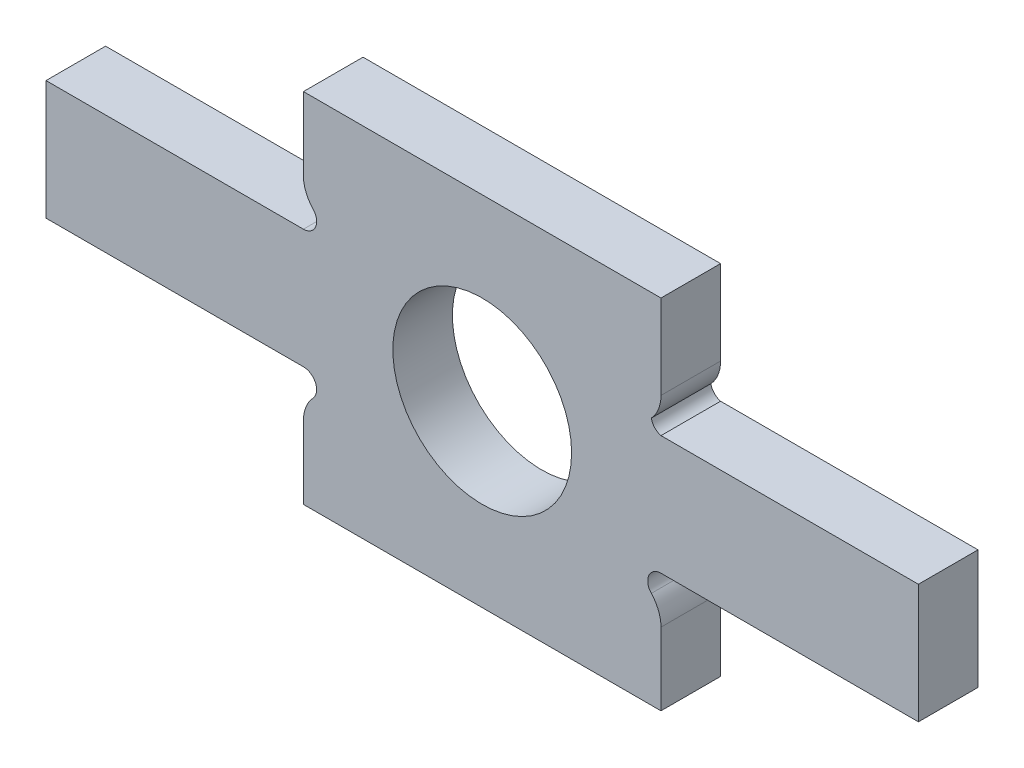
ISO-10303-21;
HEADER;
FILE_DESCRIPTION(('STEP AP214'),'2;1');
FILE_NAME('part.step','',(''),(''),'','','');
FILE_SCHEMA(('AUTOMOTIVE_DESIGN { 1 0 10303 214 1 1 1 1 }'));
ENDSEC;
DATA;
#1=APPLICATION_CONTEXT('core data for automotive mechanical design processes');
#2=APPLICATION_PROTOCOL_DEFINITION('international standard','automotive_design',2000,#1);
#3=PRODUCT_CONTEXT('',#1,'mechanical');
#4=PRODUCT('Part','Part','',(#3));
#5=PRODUCT_RELATED_PRODUCT_CATEGORY('part','',(#4));
#6=PRODUCT_DEFINITION_FORMATION('','',#4);
#7=PRODUCT_DEFINITION_CONTEXT('part definition',#1,'design');
#8=PRODUCT_DEFINITION('design','',#6,#7);
#9=PRODUCT_DEFINITION_SHAPE('','',#8);
#10=(LENGTH_UNIT() NAMED_UNIT(*) SI_UNIT(.MILLI.,.METRE.));
#11=(NAMED_UNIT(*) PLANE_ANGLE_UNIT() SI_UNIT($,.RADIAN.));
#12=(NAMED_UNIT(*) SI_UNIT($,.STERADIAN.) SOLID_ANGLE_UNIT());
#13=UNCERTAINTY_MEASURE_WITH_UNIT(LENGTH_MEASURE(1.E-05),#10,'distance_accuracy_value','');
#14=(GEOMETRIC_REPRESENTATION_CONTEXT(3) GLOBAL_UNCERTAINTY_ASSIGNED_CONTEXT((#13)) GLOBAL_UNIT_ASSIGNED_CONTEXT((#10,
#11,#12)) REPRESENTATION_CONTEXT('',''));
#15=CARTESIAN_POINT('',(0.,0.,0.));
#16=DIRECTION('',(0.,0.,1.));
#17=DIRECTION('',(1.,0.,0.));
#18=AXIS2_PLACEMENT_3D('',#15,#16,#17);
#19=CARTESIAN_POINT('',(30.0000000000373,-12.2200000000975,10.));
#20=DIRECTION('',(0.,0.,-1.));
#21=DIRECTION('',(-1.,0.,0.));
#22=AXIS2_PLACEMENT_3D('',#19,#20,#21);
#23=CYLINDRICAL_SURFACE('',#22,2.22000000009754);
#24=CARTESIAN_POINT('',(30.0000000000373,-12.2200000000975,0.));
#25=DIRECTION('',(0.,0.,-1.));
#26=DIRECTION('',(1.,0.,0.));
#27=AXIS2_PLACEMENT_3D('',#24,#25,#26);
#28=CIRCLE('',#27,2.22000000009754);
#29=CARTESIAN_POINT('',(28.3795620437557,-13.7374257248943,0.));
#30=VERTEX_POINT('',#29);
#31=CARTESIAN_POINT('',(30.0000000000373,-10.,0.));
#32=VERTEX_POINT('',#31);
#33=EDGE_CURVE('E210',#30,#32,#28,.T.);
#34=ORIENTED_EDGE('',*,*,#33,.T.);
#35=DIRECTION('',(0.,0.,-1.));
#36=VECTOR('',#35,1.);
#37=CARTESIAN_POINT('',(30.0000000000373,-10.,10.));
#38=LINE('',#37,#36);
#39=CARTESIAN_POINT('',(30.0000000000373,-10.,10.));
#40=VERTEX_POINT('',#39);
#41=EDGE_CURVE('E11',#40,#32,#38,.T.);
#42=ORIENTED_EDGE('',*,*,#41,.F.);
#43=CARTESIAN_POINT('',(30.0000000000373,-12.2200000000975,10.));
#44=DIRECTION('',(0.,0.,-1.));
#45=DIRECTION('',(1.,0.,0.));
#46=AXIS2_PLACEMENT_3D('',#43,#44,#45);
#47=CIRCLE('',#46,2.22000000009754);
#48=CARTESIAN_POINT('',(28.3795620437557,-13.7374257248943,10.));
#49=VERTEX_POINT('',#48);
#50=EDGE_CURVE('E249',#49,#40,#47,.T.);
#51=ORIENTED_EDGE('',*,*,#50,.F.);
#52=DIRECTION('',(0.,0.,-1.));
#53=VECTOR('',#52,1.);
#54=CARTESIAN_POINT('',(28.3795620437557,-13.7374257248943,10.));
#55=LINE('',#54,#53);
#56=EDGE_CURVE('E206',#49,#30,#55,.T.);
#57=ORIENTED_EDGE('',*,*,#56,.T.);
#58=EDGE_LOOP('',(#34,#42,#51,#57));
#59=FACE_BOUND('',#58,.T.);
#60=ADVANCED_FACE('F42',(#59),#23,.F.);
#61=CARTESIAN_POINT('',(30.0000000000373,-10.,10.));
#62=DIRECTION('',(0.,1.,0.));
#63=DIRECTION('',(-1.,0.,0.));
#64=AXIS2_PLACEMENT_3D('',#61,#62,#63);
#65=PLANE('',#64);
#66=DIRECTION('',(1.,0.,0.));
#67=VECTOR('',#66,1.);
#68=CARTESIAN_POINT('',(30.0000000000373,-10.,0.));
#69=LINE('',#68,#67);
#70=CARTESIAN_POINT('',(73.2000000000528,-9.99999999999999,0.));
#71=VERTEX_POINT('',#70);
#72=EDGE_CURVE('E213',#32,#71,#69,.T.);
#73=ORIENTED_EDGE('',*,*,#72,.T.);
#74=DIRECTION('',(0.,0.,-1.));
#75=VECTOR('',#74,1.);
#76=CARTESIAN_POINT('',(73.2000000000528,-9.99999999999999,10.));
#77=LINE('',#76,#75);
#78=CARTESIAN_POINT('',(73.2000000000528,-9.99999999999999,10.));
#79=VERTEX_POINT('',#78);
#80=EDGE_CURVE('E50',#79,#71,#77,.T.);
#81=ORIENTED_EDGE('',*,*,#80,.F.);
#82=DIRECTION('',(1.,0.,0.));
#83=VECTOR('',#82,1.);
#84=CARTESIAN_POINT('',(30.0000000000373,-10.,10.));
#85=LINE('',#84,#83);
#86=EDGE_CURVE('E137',#40,#79,#85,.T.);
#87=ORIENTED_EDGE('',*,*,#86,.F.);
#88=ORIENTED_EDGE('',*,*,#41,.T.);
#89=EDGE_LOOP('',(#73,#81,#87,#88));
#90=FACE_BOUND('',#89,.T.);
#91=ADVANCED_FACE('F368',(#90),#65,.F.);
#92=CARTESIAN_POINT('',(73.2000000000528,-9.99999999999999,10.));
#93=DIRECTION('',(-1.,0.,0.));
#94=DIRECTION('',(0.,0.,1.));
#95=AXIS2_PLACEMENT_3D('',#92,#93,#94);
#96=PLANE('',#95);
#97=DIRECTION('',(0.,1.,0.));
#98=VECTOR('',#97,1.);
#99=CARTESIAN_POINT('',(73.2000000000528,-9.99999999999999,0.));
#100=LINE('',#99,#98);
#101=CARTESIAN_POINT('',(73.2000000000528,10.,0.));
#102=VERTEX_POINT('',#101);
#103=EDGE_CURVE('E216',#71,#102,#100,.T.);
#104=ORIENTED_EDGE('',*,*,#103,.T.);
#105=DIRECTION('',(0.,0.,-1.));
#106=VECTOR('',#105,1.);
#107=CARTESIAN_POINT('',(73.2000000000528,10.,10.));
#108=LINE('',#107,#106);
#109=CARTESIAN_POINT('',(73.2000000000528,10.,10.));
#110=VERTEX_POINT('',#109);
#111=EDGE_CURVE('E292',#110,#102,#108,.T.);
#112=ORIENTED_EDGE('',*,*,#111,.F.);
#113=DIRECTION('',(0.,1.,0.));
#114=VECTOR('',#113,1.);
#115=CARTESIAN_POINT('',(73.2000000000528,-9.99999999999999,10.));
#116=LINE('',#115,#114);
#117=EDGE_CURVE('E300',#79,#110,#116,.T.);
#118=ORIENTED_EDGE('',*,*,#117,.F.);
#119=ORIENTED_EDGE('',*,*,#80,.T.);
#120=EDGE_LOOP('',(#104,#112,#118,#119));
#121=FACE_BOUND('',#120,.T.);
#122=ADVANCED_FACE('F298',(#121),#96,.F.);
#123=CARTESIAN_POINT('',(73.2000000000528,10.,10.));
#124=DIRECTION('',(0.,-1.,0.));
#125=DIRECTION('',(1.,0.,0.));
#126=AXIS2_PLACEMENT_3D('',#123,#124,#125);
#127=PLANE('',#126);
#128=DIRECTION('',(-1.,0.,0.));
#129=VECTOR('',#128,1.);
#130=CARTESIAN_POINT('',(73.2000000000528,10.,0.));
#131=LINE('',#130,#129);
#132=CARTESIAN_POINT('',(30.0000000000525,10.,0.));
#133=VERTEX_POINT('',#132);
#134=EDGE_CURVE('E218',#102,#133,#131,.T.);
#135=ORIENTED_EDGE('',*,*,#134,.T.);
#136=DIRECTION('',(0.,0.,-1.));
#137=VECTOR('',#136,1.);
#138=CARTESIAN_POINT('',(30.0000000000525,10.,10.));
#139=LINE('',#138,#137);
#140=CARTESIAN_POINT('',(30.0000000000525,10.,10.));
#141=VERTEX_POINT('',#140);
#142=EDGE_CURVE('E289',#141,#133,#139,.T.);
#143=ORIENTED_EDGE('',*,*,#142,.F.);
#144=DIRECTION('',(-1.,0.,0.));
#145=VECTOR('',#144,1.);
#146=CARTESIAN_POINT('',(73.2000000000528,10.,10.));
#147=LINE('',#146,#145);
#148=EDGE_CURVE('E318',#110,#141,#147,.T.);
#149=ORIENTED_EDGE('',*,*,#148,.F.);
#150=ORIENTED_EDGE('',*,*,#111,.T.);
#151=EDGE_LOOP('',(#135,#143,#149,#150));
#152=FACE_BOUND('',#151,.T.);
#153=ADVANCED_FACE('F309',(#152),#127,.F.);
#154=CARTESIAN_POINT('',(30.5612892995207,12.1478720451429,10.));
#155=DIRECTION('',(0.,0.,-1.));
#156=DIRECTION('',(-1.,0.,0.));
#157=AXIS2_PLACEMENT_3D('',#154,#155,#156);
#158=CYLINDRICAL_SURFACE('',#157,2.22000000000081);
#159=CARTESIAN_POINT('',(30.5612892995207,12.1478720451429,0.));
#160=DIRECTION('',(0.,0.,-1.));
#161=DIRECTION('',(1.,0.,0.));
#162=AXIS2_PLACEMENT_3D('',#159,#160,#161);
#163=CIRCLE('',#162,2.22000000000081);
#164=CARTESIAN_POINT('',(28.3795620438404,11.7374257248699,0.));
#165=VERTEX_POINT('',#164);
#166=EDGE_CURVE('E220',#133,#165,#163,.T.);
#167=ORIENTED_EDGE('',*,*,#166,.T.);
#168=DIRECTION('',(0.,0.,-1.));
#169=VECTOR('',#168,1.);
#170=CARTESIAN_POINT('',(28.3795620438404,11.7374257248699,10.));
#171=LINE('',#170,#169);
#172=CARTESIAN_POINT('',(28.3795620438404,11.7374257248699,10.));
#173=VERTEX_POINT('',#172);
#174=EDGE_CURVE('E286',#173,#165,#171,.T.);
#175=ORIENTED_EDGE('',*,*,#174,.F.);
#176=CARTESIAN_POINT('',(30.5612892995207,12.1478720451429,10.));
#177=DIRECTION('',(0.,0.,-1.));
#178=DIRECTION('',(1.,0.,0.));
#179=AXIS2_PLACEMENT_3D('',#176,#177,#178);
#180=CIRCLE('',#179,2.22000000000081);
#181=EDGE_CURVE('E315',#141,#173,#180,.T.);
#182=ORIENTED_EDGE('',*,*,#181,.F.);
#183=ORIENTED_EDGE('',*,*,#142,.T.);
#184=EDGE_LOOP('',(#167,#175,#182,#183));
#185=FACE_BOUND('',#184,.T.);
#186=ADVANCED_FACE('F313',(#185),#158,.F.);
#187=CARTESIAN_POINT('',(24.0000000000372,15.8385763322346,10.));
#188=DIRECTION('',(0.,0.,-1.));
#189=DIRECTION('',(-1.,0.,0.));
#190=AXIS2_PLACEMENT_3D('',#187,#188,#189);
#191=CYLINDRICAL_SURFACE('',#190,5.99999999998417);
#192=CARTESIAN_POINT('',(24.0000000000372,15.8385763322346,0.));
#193=DIRECTION('',(0.,0.,1.));
#194=DIRECTION('',(1.,0.,0.));
#195=AXIS2_PLACEMENT_3D('',#192,#193,#194);
#196=CIRCLE('',#195,5.99999999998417);
#197=CARTESIAN_POINT('',(30.0000000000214,15.8385763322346,0.));
#198=VERTEX_POINT('',#197);
#199=EDGE_CURVE('E222',#165,#198,#196,.T.);
#200=ORIENTED_EDGE('',*,*,#199,.T.);
#201=DIRECTION('',(0.,0.,-1.));
#202=VECTOR('',#201,1.);
#203=CARTESIAN_POINT('',(30.0000000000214,15.8385763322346,10.));
#204=LINE('',#203,#202);
#205=CARTESIAN_POINT('',(30.0000000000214,15.8385763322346,10.));
#206=VERTEX_POINT('',#205);
#207=EDGE_CURVE('E283',#206,#198,#204,.T.);
#208=ORIENTED_EDGE('',*,*,#207,.F.);
#209=CARTESIAN_POINT('',(24.0000000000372,15.8385763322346,10.));
#210=DIRECTION('',(0.,0.,1.));
#211=DIRECTION('',(1.,0.,0.));
#212=AXIS2_PLACEMENT_3D('',#209,#210,#211);
#213=CIRCLE('',#212,5.99999999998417);
#214=EDGE_CURVE('E317',#173,#206,#213,.T.);
#215=ORIENTED_EDGE('',*,*,#214,.F.);
#216=ORIENTED_EDGE('',*,*,#174,.T.);
#217=EDGE_LOOP('',(#200,#208,#215,#216));
#218=FACE_BOUND('',#217,.T.);
#219=ADVANCED_FACE('F381',(#218),#191,.T.);
#220=CARTESIAN_POINT('',(30.0000000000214,15.8385763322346,10.));
#221=DIRECTION('',(-1.,0.,0.));
#222=DIRECTION('',(0.,0.,1.));
#223=AXIS2_PLACEMENT_3D('',#220,#221,#222);
#224=PLANE('',#223);
#225=DIRECTION('',(0.,1.,0.));
#226=VECTOR('',#225,1.);
#227=CARTESIAN_POINT('',(30.0000000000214,15.8385763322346,0.));
#228=LINE('',#227,#226);
#229=CARTESIAN_POINT('',(30.0000000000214,30.,0.));
#230=VERTEX_POINT('',#229);
#231=EDGE_CURVE('E224',#198,#230,#228,.T.);
#232=ORIENTED_EDGE('',*,*,#231,.T.);
#233=DIRECTION('',(0.,0.,-1.));
#234=VECTOR('',#233,1.);
#235=CARTESIAN_POINT('',(30.0000000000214,30.,10.));
#236=LINE('',#235,#234);
#237=CARTESIAN_POINT('',(30.0000000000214,30.,10.));
#238=VERTEX_POINT('',#237);
#239=EDGE_CURVE('E280',#238,#230,#236,.T.);
#240=ORIENTED_EDGE('',*,*,#239,.F.);
#241=DIRECTION('',(0.,1.,0.));
#242=VECTOR('',#241,1.);
#243=CARTESIAN_POINT('',(30.0000000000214,15.8385763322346,10.));
#244=LINE('',#243,#242);
#245=EDGE_CURVE('E320',#206,#238,#244,.T.);
#246=ORIENTED_EDGE('',*,*,#245,.F.);
#247=ORIENTED_EDGE('',*,*,#207,.T.);
#248=EDGE_LOOP('',(#232,#240,#246,#247));
#249=FACE_BOUND('',#248,.T.);
#250=ADVANCED_FACE('F384',(#249),#224,.F.);
#251=CARTESIAN_POINT('',(30.0000000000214,30.,10.));
#252=DIRECTION('',(0.,-1.,0.));
#253=DIRECTION('',(0.,0.,-1.));
#254=AXIS2_PLACEMENT_3D('',#251,#252,#253);
#255=PLANE('',#254);
#256=DIRECTION('',(-1.,0.,0.));
#257=VECTOR('',#256,1.);
#258=CARTESIAN_POINT('',(30.0000000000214,30.,0.));
#259=LINE('',#258,#257);
#260=CARTESIAN_POINT('',(-30.,30.,0.));
#261=VERTEX_POINT('',#260);
#262=EDGE_CURVE('E226',#230,#261,#259,.T.);
#263=ORIENTED_EDGE('',*,*,#262,.T.);
#264=DIRECTION('',(0.,0.,-1.));
#265=VECTOR('',#264,1.);
#266=CARTESIAN_POINT('',(-30.,30.,10.));
#267=LINE('',#266,#265);
#268=CARTESIAN_POINT('',(-30.,30.,10.));
#269=VERTEX_POINT('',#268);
#270=EDGE_CURVE('E277',#269,#261,#267,.T.);
#271=ORIENTED_EDGE('',*,*,#270,.F.);
#272=DIRECTION('',(-1.,0.,0.));
#273=VECTOR('',#272,1.);
#274=CARTESIAN_POINT('',(30.0000000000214,30.,10.));
#275=LINE('',#274,#273);
#276=EDGE_CURVE('E326',#238,#269,#275,.T.);
#277=ORIENTED_EDGE('',*,*,#276,.F.);
#278=ORIENTED_EDGE('',*,*,#239,.T.);
#279=EDGE_LOOP('',(#263,#271,#277,#278));
#280=FACE_BOUND('',#279,.T.);
#281=ADVANCED_FACE('F388',(#280),#255,.F.);
#282=CARTESIAN_POINT('',(-30.,30.,10.));
#283=DIRECTION('',(1.,0.,0.));
#284=DIRECTION('',(0.,0.,-1.));
#285=AXIS2_PLACEMENT_3D('',#282,#283,#284);
#286=PLANE('',#285);
#287=DIRECTION('',(0.,-1.,0.));
#288=VECTOR('',#287,1.);
#289=CARTESIAN_POINT('',(-30.,30.,0.));
#290=LINE('',#289,#288);
#291=CARTESIAN_POINT('',(-30.,17.3740036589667,0.));
#292=VERTEX_POINT('',#291);
#293=EDGE_CURVE('E228',#261,#292,#290,.T.);
#294=ORIENTED_EDGE('',*,*,#293,.T.);
#295=DIRECTION('',(0.,0.,-1.));
#296=VECTOR('',#295,1.);
#297=CARTESIAN_POINT('',(-30.,17.3740036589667,10.));
#298=LINE('',#297,#296);
#299=CARTESIAN_POINT('',(-30.,17.3740036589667,10.));
#300=VERTEX_POINT('',#299);
#301=EDGE_CURVE('E274',#300,#292,#298,.T.);
#302=ORIENTED_EDGE('',*,*,#301,.F.);
#303=DIRECTION('',(0.,-1.,0.));
#304=VECTOR('',#303,1.);
#305=CARTESIAN_POINT('',(-30.,30.,10.));
#306=LINE('',#305,#304);
#307=EDGE_CURVE('E328',#269,#300,#306,.T.);
#308=ORIENTED_EDGE('',*,*,#307,.F.);
#309=ORIENTED_EDGE('',*,*,#270,.T.);
#310=EDGE_LOOP('',(#294,#302,#308,#309));
#311=FACE_BOUND('',#310,.T.);
#312=ADVANCED_FACE('F392',(#311),#286,.F.);
#313=CARTESIAN_POINT('',(-24.0196732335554,17.8594846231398,10.));
#314=DIRECTION('',(0.,0.,-1.));
#315=DIRECTION('',(-1.,0.,0.));
#316=AXIS2_PLACEMENT_3D('',#313,#314,#315);
#317=CYLINDRICAL_SURFACE('',#316,6.00000000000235);
#318=CARTESIAN_POINT('',(-24.0196732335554,17.8594846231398,0.));
#319=DIRECTION('',(0.,0.,1.));
#320=DIRECTION('',(1.,0.,0.));
#321=AXIS2_PLACEMENT_3D('',#318,#319,#320);
#322=CIRCLE('',#321,6.00000000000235);
#323=CARTESIAN_POINT('',(-28.3795620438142,13.7374257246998,0.));
#324=VERTEX_POINT('',#323);
#325=EDGE_CURVE('E230',#292,#324,#322,.T.);
#326=ORIENTED_EDGE('',*,*,#325,.T.);
#327=DIRECTION('',(0.,0.,-1.));
#328=VECTOR('',#327,1.);
#329=CARTESIAN_POINT('',(-28.3795620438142,13.7374257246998,10.));
#330=LINE('',#329,#328);
#331=CARTESIAN_POINT('',(-28.3795620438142,13.7374257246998,10.));
#332=VERTEX_POINT('',#331);
#333=EDGE_CURVE('E271',#332,#324,#330,.T.);
#334=ORIENTED_EDGE('',*,*,#333,.F.);
#335=CARTESIAN_POINT('',(-24.0196732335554,17.8594846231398,10.));
#336=DIRECTION('',(0.,0.,1.));
#337=DIRECTION('',(1.,0.,0.));
#338=AXIS2_PLACEMENT_3D('',#335,#336,#337);
#339=CIRCLE('',#338,6.00000000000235);
#340=EDGE_CURVE('E330',#300,#332,#339,.T.);
#341=ORIENTED_EDGE('',*,*,#340,.F.);
#342=ORIENTED_EDGE('',*,*,#301,.T.);
#343=EDGE_LOOP('',(#326,#334,#341,#342));
#344=FACE_BOUND('',#343,.T.);
#345=ADVANCED_FACE('F396',(#344),#317,.T.);
#346=CARTESIAN_POINT('',(-30.000000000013,12.2199999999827,10.));
#347=DIRECTION('',(0.,0.,-1.));
#348=DIRECTION('',(-1.,0.,0.));
#349=AXIS2_PLACEMENT_3D('',#346,#347,#348);
#350=CYLINDRICAL_SURFACE('',#349,2.21999999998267);
#351=CARTESIAN_POINT('',(-30.000000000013,12.2199999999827,0.));
#352=DIRECTION('',(0.,0.,-1.));
#353=DIRECTION('',(1.,0.,0.));
#354=AXIS2_PLACEMENT_3D('',#351,#352,#353);
#355=CIRCLE('',#354,2.21999999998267);
#356=CARTESIAN_POINT('',(-30.000000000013,10.,0.));
#357=VERTEX_POINT('',#356);
#358=EDGE_CURVE('E232',#324,#357,#355,.T.);
#359=ORIENTED_EDGE('',*,*,#358,.T.);
#360=DIRECTION('',(0.,0.,-1.));
#361=VECTOR('',#360,1.);
#362=CARTESIAN_POINT('',(-30.000000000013,10.,10.));
#363=LINE('',#362,#361);
#364=CARTESIAN_POINT('',(-30.000000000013,10.,10.));
#365=VERTEX_POINT('',#364);
#366=EDGE_CURVE('E268',#365,#357,#363,.T.);
#367=ORIENTED_EDGE('',*,*,#366,.F.);
#368=CARTESIAN_POINT('',(-30.000000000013,12.2199999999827,10.));
#369=DIRECTION('',(0.,0.,-1.));
#370=DIRECTION('',(1.,0.,0.));
#371=AXIS2_PLACEMENT_3D('',#368,#369,#370);
#372=CIRCLE('',#371,2.21999999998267);
#373=EDGE_CURVE('E332',#332,#365,#372,.T.);
#374=ORIENTED_EDGE('',*,*,#373,.F.);
#375=ORIENTED_EDGE('',*,*,#333,.T.);
#376=EDGE_LOOP('',(#359,#367,#374,#375));
#377=FACE_BOUND('',#376,.T.);
#378=ADVANCED_FACE('F400',(#377),#350,.F.);
#379=CARTESIAN_POINT('',(-30.000000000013,10.,10.));
#380=DIRECTION('',(0.,-1.,0.));
#381=DIRECTION('',(0.,0.,-1.));
#382=AXIS2_PLACEMENT_3D('',#379,#380,#381);
#383=PLANE('',#382);
#384=DIRECTION('',(-1.,0.,0.));
#385=VECTOR('',#384,1.);
#386=CARTESIAN_POINT('',(-30.000000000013,10.,0.));
#387=LINE('',#386,#385);
#388=CARTESIAN_POINT('',(-73.2000000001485,10.,0.));
#389=VERTEX_POINT('',#388);
#390=EDGE_CURVE('E234',#357,#389,#387,.T.);
#391=ORIENTED_EDGE('',*,*,#390,.T.);
#392=DIRECTION('',(0.,0.,-1.));
#393=VECTOR('',#392,1.);
#394=CARTESIAN_POINT('',(-73.2000000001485,10.,10.));
#395=LINE('',#394,#393);
#396=CARTESIAN_POINT('',(-73.2000000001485,10.,10.));
#397=VERTEX_POINT('',#396);
#398=EDGE_CURVE('E265',#397,#389,#395,.T.);
#399=ORIENTED_EDGE('',*,*,#398,.F.);
#400=DIRECTION('',(-1.,0.,0.));
#401=VECTOR('',#400,1.);
#402=CARTESIAN_POINT('',(-30.000000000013,10.,10.));
#403=LINE('',#402,#401);
#404=EDGE_CURVE('E334',#365,#397,#403,.T.);
#405=ORIENTED_EDGE('',*,*,#404,.F.);
#406=ORIENTED_EDGE('',*,*,#366,.T.);
#407=EDGE_LOOP('',(#391,#399,#405,#406));
#408=FACE_BOUND('',#407,.T.);
#409=ADVANCED_FACE('F404',(#408),#383,.F.);
#410=CARTESIAN_POINT('',(-73.2000000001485,10.,10.));
#411=DIRECTION('',(1.,0.,0.));
#412=DIRECTION('',(0.,1.,0.));
#413=AXIS2_PLACEMENT_3D('',#410,#411,#412);
#414=PLANE('',#413);
#415=DIRECTION('',(0.,-1.,0.));
#416=VECTOR('',#415,1.);
#417=CARTESIAN_POINT('',(-73.2000000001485,10.,0.));
#418=LINE('',#417,#416);
#419=CARTESIAN_POINT('',(-73.2000000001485,-10.,0.));
#420=VERTEX_POINT('',#419);
#421=EDGE_CURVE('E236',#389,#420,#418,.T.);
#422=ORIENTED_EDGE('',*,*,#421,.T.);
#423=DIRECTION('',(0.,0.,-1.));
#424=VECTOR('',#423,1.);
#425=CARTESIAN_POINT('',(-73.2000000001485,-10.,10.));
#426=LINE('',#425,#424);
#427=CARTESIAN_POINT('',(-73.2000000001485,-10.,10.));
#428=VERTEX_POINT('',#427);
#429=EDGE_CURVE('E262',#428,#420,#426,.T.);
#430=ORIENTED_EDGE('',*,*,#429,.F.);
#431=DIRECTION('',(0.,-1.,0.));
#432=VECTOR('',#431,1.);
#433=CARTESIAN_POINT('',(-73.2000000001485,10.,10.));
#434=LINE('',#433,#432);
#435=EDGE_CURVE('E336',#397,#428,#434,.T.);
#436=ORIENTED_EDGE('',*,*,#435,.F.);
#437=ORIENTED_EDGE('',*,*,#398,.T.);
#438=EDGE_LOOP('',(#422,#430,#436,#437));
#439=FACE_BOUND('',#438,.T.);
#440=ADVANCED_FACE('F408',(#439),#414,.F.);
#441=CARTESIAN_POINT('',(-73.2000000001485,-10.,10.));
#442=DIRECTION('',(0.,1.,0.));
#443=DIRECTION('',(-1.,0.,0.));
#444=AXIS2_PLACEMENT_3D('',#441,#442,#443);
#445=PLANE('',#444);
#446=DIRECTION('',(1.,0.,0.));
#447=VECTOR('',#446,1.);
#448=CARTESIAN_POINT('',(-73.2000000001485,-10.,0.));
#449=LINE('',#448,#447);
#450=CARTESIAN_POINT('',(-30.000000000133,-9.99999999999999,0.));
#451=VERTEX_POINT('',#450);
#452=EDGE_CURVE('E238',#420,#451,#449,.T.);
#453=ORIENTED_EDGE('',*,*,#452,.T.);
#454=DIRECTION('',(0.,0.,-1.));
#455=VECTOR('',#454,1.);
#456=CARTESIAN_POINT('',(-30.000000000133,-9.99999999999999,10.));
#457=LINE('',#456,#455);
#458=CARTESIAN_POINT('',(-30.000000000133,-9.99999999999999,10.));
#459=VERTEX_POINT('',#458);
#460=EDGE_CURVE('E259',#459,#451,#457,.T.);
#461=ORIENTED_EDGE('',*,*,#460,.F.);
#462=DIRECTION('',(1.,0.,0.));
#463=VECTOR('',#462,1.);
#464=CARTESIAN_POINT('',(-73.2000000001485,-10.,10.));
#465=LINE('',#464,#463);
#466=EDGE_CURVE('E338',#428,#459,#465,.T.);
#467=ORIENTED_EDGE('',*,*,#466,.F.);
#468=ORIENTED_EDGE('',*,*,#429,.T.);
#469=EDGE_LOOP('',(#453,#461,#467,#468));
#470=FACE_BOUND('',#469,.T.);
#471=ADVANCED_FACE('F412',(#470),#445,.F.);
#472=CARTESIAN_POINT('',(-30.000000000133,-12.2200000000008,10.));
#473=DIRECTION('',(0.,0.,-1.));
#474=DIRECTION('',(-1.,0.,0.));
#475=AXIS2_PLACEMENT_3D('',#472,#473,#474);
#476=CYLINDRICAL_SURFACE('',#475,2.22000000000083);
#477=CARTESIAN_POINT('',(-30.000000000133,-12.2200000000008,0.));
#478=DIRECTION('',(0.,0.,-1.));
#479=DIRECTION('',(1.,0.,0.));
#480=AXIS2_PLACEMENT_3D('',#477,#478,#479);
#481=CIRCLE('',#480,2.22000000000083);
#482=CARTESIAN_POINT('',(-28.3795620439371,-13.7374257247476,0.));
#483=VERTEX_POINT('',#482);
#484=EDGE_CURVE('E240',#451,#483,#481,.T.);
#485=ORIENTED_EDGE('',*,*,#484,.T.);
#486=DIRECTION('',(0.,0.,-1.));
#487=VECTOR('',#486,1.);
#488=CARTESIAN_POINT('',(-28.3795620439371,-13.7374257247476,10.));
#489=LINE('',#488,#487);
#490=CARTESIAN_POINT('',(-28.3795620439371,-13.7374257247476,10.));
#491=VERTEX_POINT('',#490);
#492=EDGE_CURVE('E256',#491,#483,#489,.T.);
#493=ORIENTED_EDGE('',*,*,#492,.F.);
#494=CARTESIAN_POINT('',(-30.000000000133,-12.2200000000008,10.));
#495=DIRECTION('',(0.,0.,-1.));
#496=DIRECTION('',(1.,0.,0.));
#497=AXIS2_PLACEMENT_3D('',#494,#495,#496);
#498=CIRCLE('',#497,2.22000000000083);
#499=EDGE_CURVE('E340',#459,#491,#498,.T.);
#500=ORIENTED_EDGE('',*,*,#499,.F.);
#501=ORIENTED_EDGE('',*,*,#460,.T.);
#502=EDGE_LOOP('',(#485,#493,#500,#501));
#503=FACE_BOUND('',#502,.T.);
#504=ADVANCED_FACE('F416',(#503),#476,.F.);
#505=CARTESIAN_POINT('',(-24.0000000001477,-17.8385763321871,10.));
#506=DIRECTION('',(0.,0.,-1.));
#507=DIRECTION('',(-1.,0.,0.));
#508=AXIS2_PLACEMENT_3D('',#505,#506,#507);
#509=CYLINDRICAL_SURFACE('',#508,6.00000000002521);
#510=CARTESIAN_POINT('',(-24.0000000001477,-17.8385763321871,0.));
#511=DIRECTION('',(0.,0.,1.));
#512=DIRECTION('',(1.,0.,0.));
#513=AXIS2_PLACEMENT_3D('',#510,#511,#512);
#514=CIRCLE('',#513,6.00000000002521);
#515=CARTESIAN_POINT('',(-30.0000000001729,-17.8385763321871,0.));
#516=VERTEX_POINT('',#515);
#517=EDGE_CURVE('E242',#483,#516,#514,.T.);
#518=ORIENTED_EDGE('',*,*,#517,.T.);
#519=DIRECTION('',(0.,0.,-1.));
#520=VECTOR('',#519,1.);
#521=CARTESIAN_POINT('',(-30.0000000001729,-17.8385763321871,10.));
#522=LINE('',#521,#520);
#523=CARTESIAN_POINT('',(-30.0000000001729,-17.8385763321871,10.));
#524=VERTEX_POINT('',#523);
#525=EDGE_CURVE('E253',#524,#516,#522,.T.);
#526=ORIENTED_EDGE('',*,*,#525,.F.);
#527=CARTESIAN_POINT('',(-24.0000000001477,-17.8385763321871,10.));
#528=DIRECTION('',(0.,0.,1.));
#529=DIRECTION('',(1.,0.,0.));
#530=AXIS2_PLACEMENT_3D('',#527,#528,#529);
#531=CIRCLE('',#530,6.00000000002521);
#532=EDGE_CURVE('E342',#491,#524,#531,.T.);
#533=ORIENTED_EDGE('',*,*,#532,.F.);
#534=ORIENTED_EDGE('',*,*,#492,.T.);
#535=EDGE_LOOP('',(#518,#526,#533,#534));
#536=FACE_BOUND('',#535,.T.);
#537=ADVANCED_FACE('F348',(#536),#509,.T.);
#538=CARTESIAN_POINT('',(-30.0000000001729,-17.8385763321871,10.));
#539=DIRECTION('',(1.,0.,0.));
#540=DIRECTION('',(0.,0.,-1.));
#541=AXIS2_PLACEMENT_3D('',#538,#539,#540);
#542=PLANE('',#541);
#543=DIRECTION('',(0.,-1.,0.));
#544=VECTOR('',#543,1.);
#545=CARTESIAN_POINT('',(-30.0000000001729,-17.8385763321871,0.));
#546=LINE('',#545,#544);
#547=CARTESIAN_POINT('',(-30.0000000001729,-30.,0.));
#548=VERTEX_POINT('',#547);
#549=EDGE_CURVE('E244',#516,#548,#546,.T.);
#550=ORIENTED_EDGE('',*,*,#549,.T.);
#551=DIRECTION('',(0.,0.,-1.));
#552=VECTOR('',#551,1.);
#553=CARTESIAN_POINT('',(-30.0000000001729,-30.,10.));
#554=LINE('',#553,#552);
#555=CARTESIAN_POINT('',(-30.0000000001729,-30.,10.));
#556=VERTEX_POINT('',#555);
#557=EDGE_CURVE('E201',#556,#548,#554,.T.);
#558=ORIENTED_EDGE('',*,*,#557,.F.);
#559=DIRECTION('',(0.,-1.,0.));
#560=VECTOR('',#559,1.);
#561=CARTESIAN_POINT('',(-30.0000000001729,-17.8385763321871,10.));
#562=LINE('',#561,#560);
#563=EDGE_CURVE('E192',#524,#556,#562,.T.);
#564=ORIENTED_EDGE('',*,*,#563,.F.);
#565=ORIENTED_EDGE('',*,*,#525,.T.);
#566=EDGE_LOOP('',(#550,#558,#564,#565));
#567=FACE_BOUND('',#566,.T.);
#568=ADVANCED_FACE('F352',(#567),#542,.F.);
#569=CARTESIAN_POINT('',(-30.0000000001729,-30.,10.));
#570=DIRECTION('',(0.,1.,0.));
#571=DIRECTION('',(-1.,0.,0.));
#572=AXIS2_PLACEMENT_3D('',#569,#570,#571);
#573=PLANE('',#572);
#574=DIRECTION('',(1.,0.,0.));
#575=VECTOR('',#574,1.);
#576=CARTESIAN_POINT('',(-30.0000000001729,-30.,0.));
#577=LINE('',#576,#575);
#578=CARTESIAN_POINT('',(29.9999999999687,-30.,0.));
#579=VERTEX_POINT('',#578);
#580=EDGE_CURVE('E200',#548,#579,#577,.T.);
#581=ORIENTED_EDGE('',*,*,#580,.T.);
#582=DIRECTION('',(0.,0.,-1.));
#583=VECTOR('',#582,1.);
#584=CARTESIAN_POINT('',(29.9999999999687,-30.,10.));
#585=LINE('',#584,#583);
#586=CARTESIAN_POINT('',(29.9999999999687,-30.,10.));
#587=VERTEX_POINT('',#586);
#588=EDGE_CURVE('E197',#587,#579,#585,.T.);
#589=ORIENTED_EDGE('',*,*,#588,.F.);
#590=DIRECTION('',(1.,0.,0.));
#591=VECTOR('',#590,1.);
#592=CARTESIAN_POINT('',(-30.0000000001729,-30.,10.));
#593=LINE('',#592,#591);
#594=EDGE_CURVE('E186',#556,#587,#593,.T.);
#595=ORIENTED_EDGE('',*,*,#594,.F.);
#596=ORIENTED_EDGE('',*,*,#557,.T.);
#597=EDGE_LOOP('',(#581,#589,#595,#596));
#598=FACE_BOUND('',#597,.T.);
#599=ADVANCED_FACE('F198',(#598),#573,.F.);
#600=CARTESIAN_POINT('',(29.9999999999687,-30.,10.));
#601=DIRECTION('',(-1.,0.,0.));
#602=DIRECTION('',(0.,-1.,0.));
#603=AXIS2_PLACEMENT_3D('',#600,#601,#602);
#604=PLANE('',#603);
#605=DIRECTION('',(0.,1.,0.));
#606=VECTOR('',#605,1.);
#607=CARTESIAN_POINT('',(29.9999999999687,-30.,0.));
#608=LINE('',#607,#606);
#609=CARTESIAN_POINT('',(29.9999999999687,-17.8385763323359,0.));
#610=VERTEX_POINT('',#609);
#611=EDGE_CURVE('E123',#579,#610,#608,.T.);
#612=ORIENTED_EDGE('',*,*,#611,.T.);
#613=DIRECTION('',(0.,0.,-1.));
#614=VECTOR('',#613,1.);
#615=CARTESIAN_POINT('',(29.9999999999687,-17.8385763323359,10.));
#616=LINE('',#615,#614);
#617=CARTESIAN_POINT('',(29.9999999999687,-17.8385763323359,10.));
#618=VERTEX_POINT('',#617);
#619=EDGE_CURVE('E202',#618,#610,#616,.T.);
#620=ORIENTED_EDGE('',*,*,#619,.F.);
#621=DIRECTION('',(0.,1.,0.));
#622=VECTOR('',#621,1.);
#623=CARTESIAN_POINT('',(29.9999999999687,-30.,10.));
#624=LINE('',#623,#622);
#625=EDGE_CURVE('E190',#587,#618,#624,.T.);
#626=ORIENTED_EDGE('',*,*,#625,.F.);
#627=ORIENTED_EDGE('',*,*,#588,.T.);
#628=EDGE_LOOP('',(#612,#620,#626,#627));
#629=FACE_BOUND('',#628,.T.);
#630=ADVANCED_FACE('F204',(#629),#604,.F.);
#631=CARTESIAN_POINT('',(23.9999999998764,-17.8385763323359,10.));
#632=DIRECTION('',(0.,0.,-1.));
#633=DIRECTION('',(-1.,0.,0.));
#634=AXIS2_PLACEMENT_3D('',#631,#632,#633);
#635=CYLINDRICAL_SURFACE('',#634,6.00000000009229);
#636=CARTESIAN_POINT('',(23.9999999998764,-17.8385763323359,0.));
#637=DIRECTION('',(0.,0.,1.));
#638=DIRECTION('',(1.,0.,0.));
#639=AXIS2_PLACEMENT_3D('',#636,#637,#638);
#640=CIRCLE('',#639,6.00000000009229);
#641=EDGE_CURVE('E129',#610,#30,#640,.T.);
#642=ORIENTED_EDGE('',*,*,#641,.T.);
#643=ORIENTED_EDGE('',*,*,#56,.F.);
#644=CARTESIAN_POINT('',(23.9999999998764,-17.8385763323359,10.));
#645=DIRECTION('',(0.,0.,1.));
#646=DIRECTION('',(1.,0.,0.));
#647=AXIS2_PLACEMENT_3D('',#644,#645,#646);
#648=CIRCLE('',#647,6.00000000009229);
#649=EDGE_CURVE('E58',#618,#49,#648,.T.);
#650=ORIENTED_EDGE('',*,*,#649,.F.);
#651=ORIENTED_EDGE('',*,*,#619,.T.);
#652=EDGE_LOOP('',(#642,#643,#650,#651));
#653=FACE_BOUND('',#652,.T.);
#654=ADVANCED_FACE('F356',(#653),#635,.T.);
#655=CARTESIAN_POINT('',(30.0000000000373,-12.2200000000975,10.));
#656=DIRECTION('',(0.,0.,1.));
#657=DIRECTION('',(1.,0.,0.));
#658=AXIS2_PLACEMENT_3D('',#655,#656,#657);
#659=PLANE('',#658);
#660=CARTESIAN_POINT('',(0.,0.,10.));
#661=DIRECTION('',(0.,0.,1.));
#662=DIRECTION('',(1.,0.,0.));
#663=AXIS2_PLACEMENT_3D('',#660,#661,#662);
#664=CIRCLE('',#663,15.);
#665=CARTESIAN_POINT('',(15.,0.,10.));
#666=VERTEX_POINT('',#665);
#667=EDGE_CURVE('E472',#666,#666,#664,.T.);
#668=ORIENTED_EDGE('',*,*,#667,.F.);
#669=EDGE_LOOP('',(#668));
#670=FACE_BOUND('',#669,.T.);
#671=ORIENTED_EDGE('',*,*,#50,.T.);
#672=ORIENTED_EDGE('',*,*,#86,.T.);
#673=ORIENTED_EDGE('',*,*,#117,.T.);
#674=ORIENTED_EDGE('',*,*,#148,.T.);
#675=ORIENTED_EDGE('',*,*,#181,.T.);
#676=ORIENTED_EDGE('',*,*,#214,.T.);
#677=ORIENTED_EDGE('',*,*,#245,.T.);
#678=ORIENTED_EDGE('',*,*,#276,.T.);
#679=ORIENTED_EDGE('',*,*,#307,.T.);
#680=ORIENTED_EDGE('',*,*,#340,.T.);
#681=ORIENTED_EDGE('',*,*,#373,.T.);
#682=ORIENTED_EDGE('',*,*,#404,.T.);
#683=ORIENTED_EDGE('',*,*,#435,.T.);
#684=ORIENTED_EDGE('',*,*,#466,.T.);
#685=ORIENTED_EDGE('',*,*,#499,.T.);
#686=ORIENTED_EDGE('',*,*,#532,.T.);
#687=ORIENTED_EDGE('',*,*,#563,.T.);
#688=ORIENTED_EDGE('',*,*,#594,.T.);
#689=ORIENTED_EDGE('',*,*,#625,.T.);
#690=ORIENTED_EDGE('',*,*,#649,.T.);
#691=EDGE_LOOP('',(#671,#672,#673,#674,#675,#676,#677,#678,#679,#680,#681,#682,#683,#684,#685,
#686,#687,#688,#689,#690));
#692=FACE_BOUND('',#691,.T.);
#693=ADVANCED_FACE('F188',(#670,#692),#659,.T.);
#694=CARTESIAN_POINT('',(30.0000000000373,-12.2200000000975,0.));
#695=DIRECTION('',(0.,0.,1.));
#696=DIRECTION('',(1.,0.,0.));
#697=AXIS2_PLACEMENT_3D('',#694,#695,#696);
#698=PLANE('',#697);
#699=CARTESIAN_POINT('',(0.,0.,0.));
#700=DIRECTION('',(0.,0.,1.));
#701=DIRECTION('',(1.,0.,0.));
#702=AXIS2_PLACEMENT_3D('',#699,#700,#701);
#703=CIRCLE('',#702,15.);
#704=CARTESIAN_POINT('',(15.,0.,0.));
#705=VERTEX_POINT('',#704);
#706=EDGE_CURVE('E214',#705,#705,#703,.T.);
#707=ORIENTED_EDGE('',*,*,#706,.T.);
#708=EDGE_LOOP('',(#707));
#709=FACE_BOUND('',#708,.T.);
#710=ORIENTED_EDGE('',*,*,#33,.F.);
#711=ORIENTED_EDGE('',*,*,#641,.F.);
#712=ORIENTED_EDGE('',*,*,#611,.F.);
#713=ORIENTED_EDGE('',*,*,#580,.F.);
#714=ORIENTED_EDGE('',*,*,#549,.F.);
#715=ORIENTED_EDGE('',*,*,#517,.F.);
#716=ORIENTED_EDGE('',*,*,#484,.F.);
#717=ORIENTED_EDGE('',*,*,#452,.F.);
#718=ORIENTED_EDGE('',*,*,#421,.F.);
#719=ORIENTED_EDGE('',*,*,#390,.F.);
#720=ORIENTED_EDGE('',*,*,#358,.F.);
#721=ORIENTED_EDGE('',*,*,#325,.F.);
#722=ORIENTED_EDGE('',*,*,#293,.F.);
#723=ORIENTED_EDGE('',*,*,#262,.F.);
#724=ORIENTED_EDGE('',*,*,#231,.F.);
#725=ORIENTED_EDGE('',*,*,#199,.F.);
#726=ORIENTED_EDGE('',*,*,#166,.F.);
#727=ORIENTED_EDGE('',*,*,#134,.F.);
#728=ORIENTED_EDGE('',*,*,#103,.F.);
#729=ORIENTED_EDGE('',*,*,#72,.F.);
#730=EDGE_LOOP('',(#710,#711,#712,#713,#714,#715,#716,#717,#718,#719,#720,#721,#722,#723,#724,
#725,#726,#727,#728,#729));
#731=FACE_BOUND('',#730,.T.);
#732=ADVANCED_FACE('F304',(#709,#731),#698,.F.);
#733=CARTESIAN_POINT('',(0.,0.,0.));
#734=DIRECTION('',(0.,0.,1.));
#735=DIRECTION('',(1.,0.,0.));
#736=AXIS2_PLACEMENT_3D('',#733,#734,#735);
#737=CYLINDRICAL_SURFACE('',#736,15.);
#738=ORIENTED_EDGE('',*,*,#706,.F.);
#739=EDGE_LOOP('',(#738));
#740=FACE_BOUND('',#739,.T.);
#741=ORIENTED_EDGE('',*,*,#667,.T.);
#742=EDGE_LOOP('',(#741));
#743=FACE_BOUND('',#742,.T.);
#744=ADVANCED_FACE('F455',(#740,#743),#737,.F.);
#745=CLOSED_SHELL('',(#60,#91,#122,#153,#186,#219,#250,#281,#312,#345,#378,#409,#440,#471,#504,
#537,#568,#599,#630,#654,#693,#732,#744));
#746=MANIFOLD_SOLID_BREP('B2',#745);
#747=ADVANCED_BREP_SHAPE_REPRESENTATION('',(#18,#746),#14);
#748=SHAPE_DEFINITION_REPRESENTATION(#9,#747);
ENDSEC;
END-ISO-10303-21;
